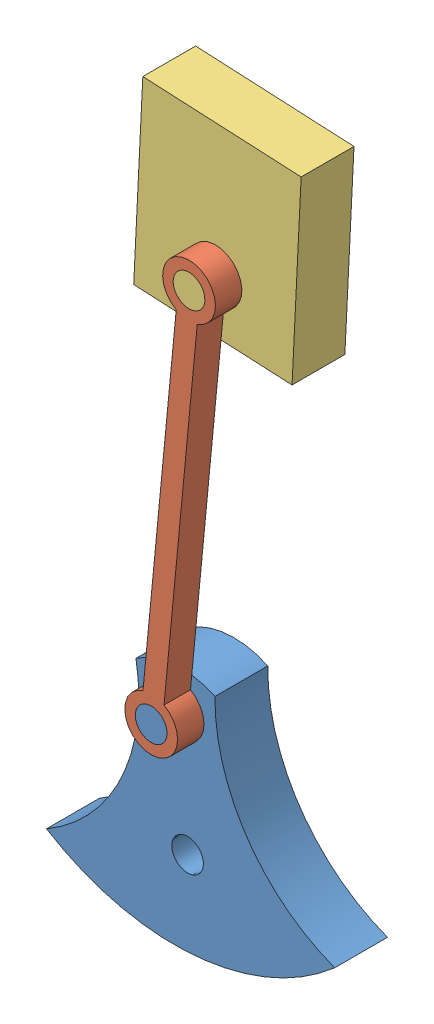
SolidWorks assembly c17-tut01.SLDASM, configuration Default (file format 6000). Lengths in mm.
Overall size (58.31 141.4 15).
3 component instances, 3 part files, 0 mates.
Components (placement in the parent):
- Block-Crank-1-1-1: Block-Crank-1-1.sldprt [Default] at (-1.8869 22.9225 0) x (0.996629 0.082038 0) z (0 0 1) size (54.72 45.93 15)
- Piston_rod-1-2-1: Piston_rod-1-2.sldprt [Default] at (5.2763 97.5796 0) x (0.995429 -0.095509 0) z (0 0 1) size (10 85 5)
- Piston_tank-1-3-1: Piston_tank-1-3.sldprt [Default] at (5.2763 97.5796 0) x (0.998786 -0.049263 0) z (0 0 1) size (30 35 15)
